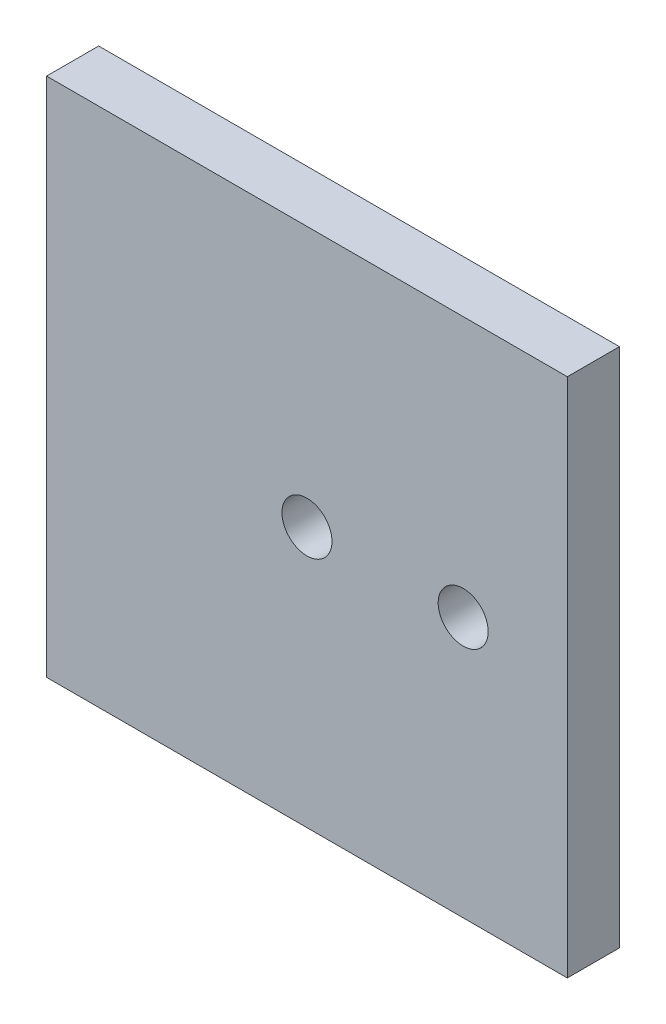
ISO-10303-21;
HEADER;
FILE_DESCRIPTION(('STEP AP214'),'2;1');
FILE_NAME('part.step','',(''),(''),'','','');
FILE_SCHEMA(('AUTOMOTIVE_DESIGN { 1 0 10303 214 1 1 1 1 }'));
ENDSEC;
DATA;
#1=APPLICATION_CONTEXT('core data for automotive mechanical design processes');
#2=APPLICATION_PROTOCOL_DEFINITION('international standard','automotive_design',2000,#1);
#3=PRODUCT_CONTEXT('',#1,'mechanical');
#4=PRODUCT('Part','Part','',(#3));
#5=PRODUCT_RELATED_PRODUCT_CATEGORY('part','',(#4));
#6=PRODUCT_DEFINITION_FORMATION('','',#4);
#7=PRODUCT_DEFINITION_CONTEXT('part definition',#1,'design');
#8=PRODUCT_DEFINITION('design','',#6,#7);
#9=PRODUCT_DEFINITION_SHAPE('','',#8);
#10=(LENGTH_UNIT() NAMED_UNIT(*) SI_UNIT(.MILLI.,.METRE.));
#11=(NAMED_UNIT(*) PLANE_ANGLE_UNIT() SI_UNIT($,.RADIAN.));
#12=(NAMED_UNIT(*) SI_UNIT($,.STERADIAN.) SOLID_ANGLE_UNIT());
#13=UNCERTAINTY_MEASURE_WITH_UNIT(LENGTH_MEASURE(1.E-05),#10,'distance_accuracy_value','');
#14=(GEOMETRIC_REPRESENTATION_CONTEXT(3) GLOBAL_UNCERTAINTY_ASSIGNED_CONTEXT((#13)) GLOBAL_UNIT_ASSIGNED_CONTEXT((#10,
#11,#12)) REPRESENTATION_CONTEXT('',''));
#15=CARTESIAN_POINT('',(0.,0.,0.));
#16=DIRECTION('',(0.,0.,1.));
#17=DIRECTION('',(1.,0.,0.));
#18=AXIS2_PLACEMENT_3D('',#15,#16,#17);
#19=CARTESIAN_POINT('',(0.,0.,12.7));
#20=DIRECTION('',(1.,0.,0.));
#21=DIRECTION('',(0.,0.,-1.));
#22=AXIS2_PLACEMENT_3D('',#19,#20,#21);
#23=PLANE('',#22);
#24=DIRECTION('',(0.,-1.,0.));
#25=VECTOR('',#24,1.);
#26=CARTESIAN_POINT('',(0.,0.,0.));
#27=LINE('',#26,#25);
#28=CARTESIAN_POINT('',(0.,127.,0.));
#29=VERTEX_POINT('',#28);
#30=CARTESIAN_POINT('',(0.,0.,0.));
#31=VERTEX_POINT('',#30);
#32=EDGE_CURVE('E106',#29,#31,#27,.T.);
#33=ORIENTED_EDGE('',*,*,#32,.T.);
#34=DIRECTION('',(0.,0.,-1.));
#35=VECTOR('',#34,1.);
#36=CARTESIAN_POINT('',(0.,0.,12.7));
#37=LINE('',#36,#35);
#38=CARTESIAN_POINT('',(0.,0.,12.7));
#39=VERTEX_POINT('',#38);
#40=EDGE_CURVE('E11',#39,#31,#37,.T.);
#41=ORIENTED_EDGE('',*,*,#40,.F.);
#42=DIRECTION('',(0.,-1.,0.));
#43=VECTOR('',#42,1.);
#44=CARTESIAN_POINT('',(0.,0.,12.7));
#45=LINE('',#44,#43);
#46=CARTESIAN_POINT('',(0.,127.,12.7));
#47=VERTEX_POINT('',#46);
#48=EDGE_CURVE('E94',#47,#39,#45,.T.);
#49=ORIENTED_EDGE('',*,*,#48,.F.);
#50=DIRECTION('',(0.,0.,-1.));
#51=VECTOR('',#50,1.);
#52=CARTESIAN_POINT('',(0.,127.,12.7));
#53=LINE('',#52,#51);
#54=EDGE_CURVE('E105',#47,#29,#53,.T.);
#55=ORIENTED_EDGE('',*,*,#54,.T.);
#56=EDGE_LOOP('',(#33,#41,#49,#55));
#57=FACE_BOUND('',#56,.T.);
#58=ADVANCED_FACE('F43',(#57),#23,.F.);
#59=CARTESIAN_POINT('',(0.,0.,12.7));
#60=DIRECTION('',(0.,1.,0.));
#61=DIRECTION('',(0.,0.,1.));
#62=AXIS2_PLACEMENT_3D('',#59,#60,#61);
#63=PLANE('',#62);
#64=DIRECTION('',(1.,0.,0.));
#65=VECTOR('',#64,1.);
#66=CARTESIAN_POINT('',(0.,0.,0.));
#67=LINE('',#66,#65);
#68=CARTESIAN_POINT('',(127.,0.,0.));
#69=VERTEX_POINT('',#68);
#70=EDGE_CURVE('E98',#31,#69,#67,.T.);
#71=ORIENTED_EDGE('',*,*,#70,.T.);
#72=DIRECTION('',(0.,0.,-1.));
#73=VECTOR('',#72,1.);
#74=CARTESIAN_POINT('',(127.,0.,12.7));
#75=LINE('',#74,#73);
#76=CARTESIAN_POINT('',(127.,0.,12.7));
#77=VERTEX_POINT('',#76);
#78=EDGE_CURVE('E51',#77,#69,#75,.T.);
#79=ORIENTED_EDGE('',*,*,#78,.F.);
#80=DIRECTION('',(1.,0.,0.));
#81=VECTOR('',#80,1.);
#82=CARTESIAN_POINT('',(0.,0.,12.7));
#83=LINE('',#82,#81);
#84=EDGE_CURVE('E90',#39,#77,#83,.T.);
#85=ORIENTED_EDGE('',*,*,#84,.F.);
#86=ORIENTED_EDGE('',*,*,#40,.T.);
#87=EDGE_LOOP('',(#71,#79,#85,#86));
#88=FACE_BOUND('',#87,.T.);
#89=ADVANCED_FACE('F100',(#88),#63,.F.);
#90=CARTESIAN_POINT('',(127.,0.,12.7));
#91=DIRECTION('',(-1.,0.,0.));
#92=DIRECTION('',(0.,0.,1.));
#93=AXIS2_PLACEMENT_3D('',#90,#91,#92);
#94=PLANE('',#93);
#95=DIRECTION('',(0.,1.,0.));
#96=VECTOR('',#95,1.);
#97=CARTESIAN_POINT('',(127.,0.,0.));
#98=LINE('',#97,#96);
#99=CARTESIAN_POINT('',(127.,127.,0.));
#100=VERTEX_POINT('',#99);
#101=EDGE_CURVE('E79',#69,#100,#98,.T.);
#102=ORIENTED_EDGE('',*,*,#101,.T.);
#103=DIRECTION('',(0.,0.,-1.));
#104=VECTOR('',#103,1.);
#105=CARTESIAN_POINT('',(127.,127.,12.7));
#106=LINE('',#105,#104);
#107=CARTESIAN_POINT('',(127.,127.,12.7));
#108=VERTEX_POINT('',#107);
#109=EDGE_CURVE('E97',#108,#100,#106,.T.);
#110=ORIENTED_EDGE('',*,*,#109,.F.);
#111=DIRECTION('',(0.,1.,0.));
#112=VECTOR('',#111,1.);
#113=CARTESIAN_POINT('',(127.,0.,12.7));
#114=LINE('',#113,#112);
#115=EDGE_CURVE('E95',#77,#108,#114,.T.);
#116=ORIENTED_EDGE('',*,*,#115,.F.);
#117=ORIENTED_EDGE('',*,*,#78,.T.);
#118=EDGE_LOOP('',(#102,#110,#116,#117));
#119=FACE_BOUND('',#118,.T.);
#120=ADVANCED_FACE('F99',(#119),#94,.F.);
#121=CARTESIAN_POINT('',(0.,127.,12.7));
#122=DIRECTION('',(0.,-1.,0.));
#123=DIRECTION('',(0.,0.,-1.));
#124=AXIS2_PLACEMENT_3D('',#121,#122,#123);
#125=PLANE('',#124);
#126=DIRECTION('',(-1.,0.,0.));
#127=VECTOR('',#126,1.);
#128=CARTESIAN_POINT('',(0.,127.,0.));
#129=LINE('',#128,#127);
#130=EDGE_CURVE('E85',#100,#29,#129,.T.);
#131=ORIENTED_EDGE('',*,*,#130,.T.);
#132=ORIENTED_EDGE('',*,*,#54,.F.);
#133=DIRECTION('',(-1.,0.,0.));
#134=VECTOR('',#133,1.);
#135=CARTESIAN_POINT('',(0.,127.,12.7));
#136=LINE('',#135,#134);
#137=EDGE_CURVE('E56',#108,#47,#136,.T.);
#138=ORIENTED_EDGE('',*,*,#137,.F.);
#139=ORIENTED_EDGE('',*,*,#109,.T.);
#140=EDGE_LOOP('',(#131,#132,#138,#139));
#141=FACE_BOUND('',#140,.T.);
#142=ADVANCED_FACE('F111',(#141),#125,.F.);
#143=CARTESIAN_POINT('',(0.,127.,12.7));
#144=DIRECTION('',(0.,0.,-1.));
#145=DIRECTION('',(-1.,0.,0.));
#146=AXIS2_PLACEMENT_3D('',#143,#144,#145);
#147=PLANE('',#146);
#148=CARTESIAN_POINT('',(63.5,63.5,12.6999999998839));
#149=DIRECTION('',(0.,0.,1.));
#150=DIRECTION('',(1.,0.,0.));
#151=AXIS2_PLACEMENT_3D('',#148,#149,#150);
#152=CIRCLE('',#151,6.09999999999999);
#153=CARTESIAN_POINT('',(69.6,63.5,12.6999999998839));
#154=VERTEX_POINT('',#153);
#155=EDGE_CURVE('E127',#154,#154,#152,.T.);
#156=ORIENTED_EDGE('',*,*,#155,.F.);
#157=EDGE_LOOP('',(#156));
#158=FACE_BOUND('',#157,.T.);
#159=CARTESIAN_POINT('',(101.6,63.5,12.7));
#160=DIRECTION('',(0.,0.,1.));
#161=DIRECTION('',(1.,0.,0.));
#162=AXIS2_PLACEMENT_3D('',#159,#160,#161);
#163=CIRCLE('',#162,6.09999999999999);
#164=CARTESIAN_POINT('',(107.7,63.5,12.7));
#165=VERTEX_POINT('',#164);
#166=EDGE_CURVE('E116',#165,#165,#163,.T.);
#167=ORIENTED_EDGE('',*,*,#166,.F.);
#168=EDGE_LOOP('',(#167));
#169=FACE_BOUND('',#168,.T.);
#170=ORIENTED_EDGE('',*,*,#48,.T.);
#171=ORIENTED_EDGE('',*,*,#84,.T.);
#172=ORIENTED_EDGE('',*,*,#115,.T.);
#173=ORIENTED_EDGE('',*,*,#137,.T.);
#174=EDGE_LOOP('',(#170,#171,#172,#173));
#175=FACE_BOUND('',#174,.T.);
#176=ADVANCED_FACE('F89',(#158,#169,#175),#147,.F.);
#177=CARTESIAN_POINT('',(0.,127.,0.));
#178=DIRECTION('',(0.,0.,-1.));
#179=DIRECTION('',(-1.,0.,0.));
#180=AXIS2_PLACEMENT_3D('',#177,#178,#179);
#181=PLANE('',#180);
#182=CARTESIAN_POINT('',(63.5,63.5,0.));
#183=DIRECTION('',(0.,0.,1.));
#184=DIRECTION('',(1.,0.,0.));
#185=AXIS2_PLACEMENT_3D('',#182,#183,#184);
#186=CIRCLE('',#185,6.09999999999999);
#187=CARTESIAN_POINT('',(69.6,63.5,0.));
#188=VERTEX_POINT('',#187);
#189=EDGE_CURVE('E124',#188,#188,#186,.T.);
#190=ORIENTED_EDGE('',*,*,#189,.T.);
#191=EDGE_LOOP('',(#190));
#192=FACE_BOUND('',#191,.T.);
#193=CARTESIAN_POINT('',(101.6,63.5,0.));
#194=DIRECTION('',(0.,0.,1.));
#195=DIRECTION('',(1.,0.,0.));
#196=AXIS2_PLACEMENT_3D('',#193,#194,#195);
#197=CIRCLE('',#196,6.09999999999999);
#198=CARTESIAN_POINT('',(107.7,63.5,0.));
#199=VERTEX_POINT('',#198);
#200=EDGE_CURVE('E108',#199,#199,#197,.T.);
#201=ORIENTED_EDGE('',*,*,#200,.T.);
#202=EDGE_LOOP('',(#201));
#203=FACE_BOUND('',#202,.T.);
#204=ORIENTED_EDGE('',*,*,#32,.F.);
#205=ORIENTED_EDGE('',*,*,#130,.F.);
#206=ORIENTED_EDGE('',*,*,#101,.F.);
#207=ORIENTED_EDGE('',*,*,#70,.F.);
#208=EDGE_LOOP('',(#204,#205,#206,#207));
#209=FACE_BOUND('',#208,.T.);
#210=ADVANCED_FACE('F119',(#192,#203,#209),#181,.T.);
#211=CARTESIAN_POINT('',(101.6,63.5,0.));
#212=DIRECTION('',(0.,0.,1.));
#213=DIRECTION('',(1.,0.,0.));
#214=AXIS2_PLACEMENT_3D('',#211,#212,#213);
#215=CYLINDRICAL_SURFACE('',#214,6.09999999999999);
#216=ORIENTED_EDGE('',*,*,#200,.F.);
#217=EDGE_LOOP('',(#216));
#218=FACE_BOUND('',#217,.T.);
#219=ORIENTED_EDGE('',*,*,#166,.T.);
#220=EDGE_LOOP('',(#219));
#221=FACE_BOUND('',#220,.T.);
#222=ADVANCED_FACE('F140',(#218,#221),#215,.F.);
#223=CARTESIAN_POINT('',(63.5,63.5,0.));
#224=DIRECTION('',(0.,0.,1.));
#225=DIRECTION('',(1.,0.,0.));
#226=AXIS2_PLACEMENT_3D('',#223,#224,#225);
#227=CYLINDRICAL_SURFACE('',#226,6.09999999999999);
#228=ORIENTED_EDGE('',*,*,#189,.F.);
#229=EDGE_LOOP('',(#228));
#230=FACE_BOUND('',#229,.T.);
#231=ORIENTED_EDGE('',*,*,#155,.T.);
#232=EDGE_LOOP('',(#231));
#233=FACE_BOUND('',#232,.T.);
#234=ADVANCED_FACE('F133',(#230,#233),#227,.F.);
#235=CLOSED_SHELL('',(#58,#89,#120,#142,#176,#210,#222,#234));
#236=MANIFOLD_SOLID_BREP('B2',#235);
#237=ADVANCED_BREP_SHAPE_REPRESENTATION('',(#18,#236),#14);
#238=SHAPE_DEFINITION_REPRESENTATION(#9,#237);
ENDSEC;
END-ISO-10303-21;
